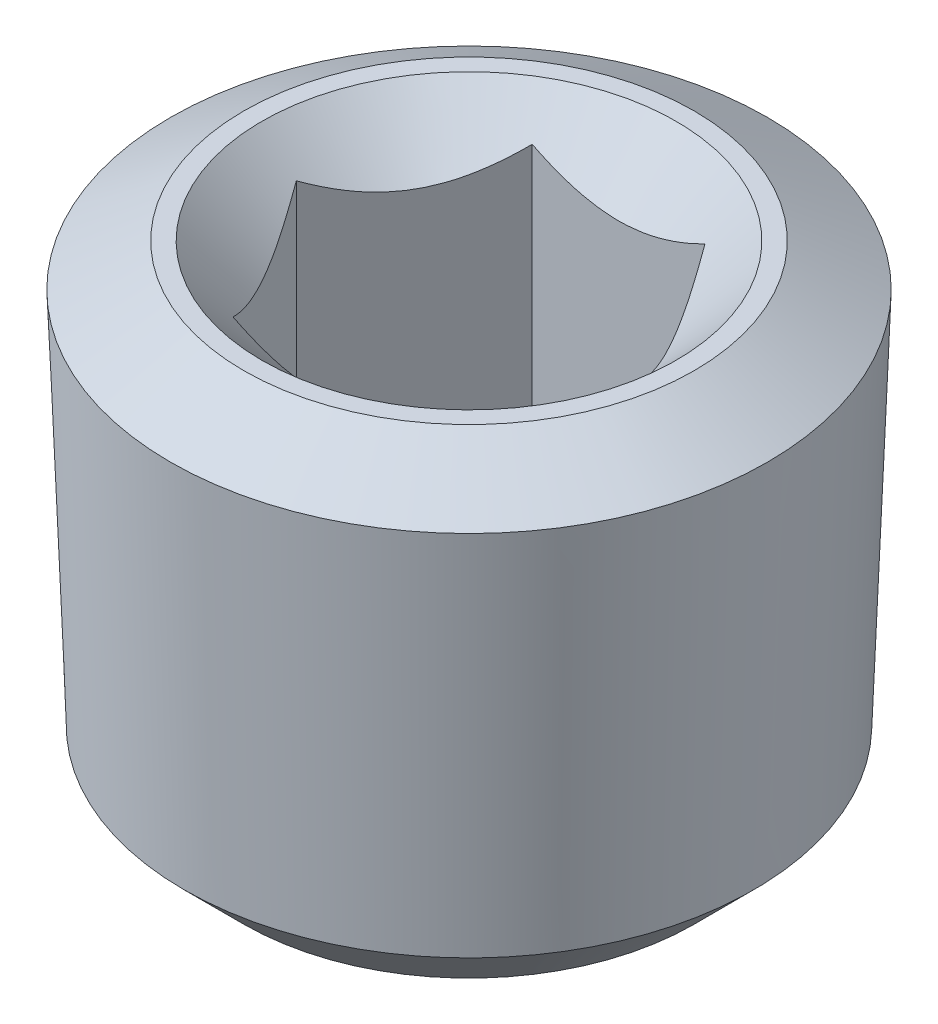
from build123d import *

# Parameters (mm, degrees)
CUT_EXTRUDE1_START = -3.81
CUT_EXTRUDE1_DEPTH = 3.354493


with BuildPart() as part:
    # Sketch2 → Revolve1 (revolve)
    with BuildSketch(Plane.XY, mode=Mode.PRIVATE) as revolve1_sk:
        Polygon((0, 0), (-2.981587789, 0), (-3.9546183, -0.561779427), (-3.772420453, -5.559167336), (-2.981587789, -6.35), (0, -6.35), align=None)
    revolve(revolve1_sk.sketch.rotate(Axis((0, 10.744282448, 0), (0, -1, 0)), 270), axis=Axis((0, 10.744282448, 0), (0, -1, 0)))

    # Sketch3 → Cut-Revolve1 (revolve, cut)
    with BuildSketch(Plane.XY, mode=Mode.PRIVATE) as cut_revolve1_sk:
        Polygon((0, 0), (-2.7432, 0), (-1.9812, -0.762), (-1.9812, -3.81), (0, -5.000425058), align=None)
    revolve(cut_revolve1_sk.sketch.rotate(Axis((0, 2.934222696, 0), (0, -1, 0)), 270), axis=Axis((0, 2.934222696, 0), (0, -1, 0)), mode=Mode.SUBTRACT)

    # Sketch4 → Cut-Extrude1 (cut)
    with BuildSketch(Plane(origin=(0, 0, 0), x_dir=(1, 0, 0), z_dir=(0, 1, 0)).offset(CUT_EXTRUDE1_START)):
        Polygon((-1.143846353, -1.9812), (1.143846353, -1.9812), (2.287692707, 0), (1.143846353, 1.9812), (-1.143846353, 1.9812), (-2.287692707, 0), align=None)
    extrude(amount=CUT_EXTRUDE1_DEPTH, mode=Mode.SUBTRACT)


solid = part.part
